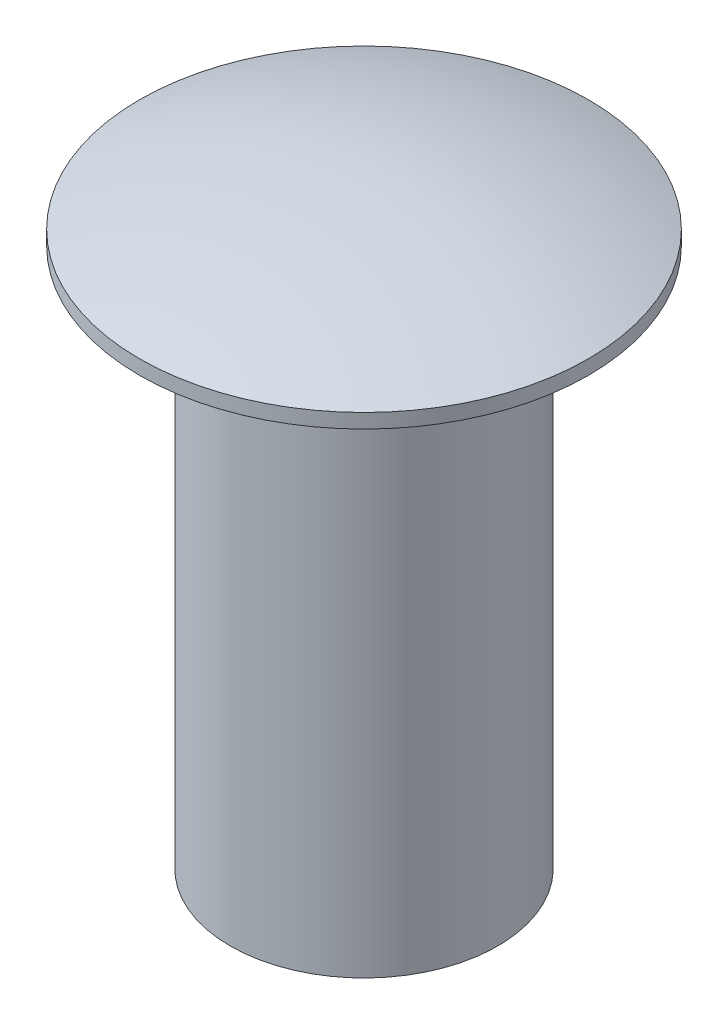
from build123d import *

# Parameters (mm, degrees)
SKETCH1_R           = 1.1811
BOSS_EXTRUDE1_DEPTH = 4.7625
SKETCH2_R           = 1.9812
BOSS_EXTRUDE2_DEPTH = 0.127
DOME1_FACE_RADIUS   = 1.9812
DOME1_HEIGHT        = 0.381
SKETCH3_R           = 0.943992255
CUT_EXTRUDE1_DEPTH  = 0.762


with BuildPart() as part:
    # Sketch1 → Boss-Extrude1 (new body)
    with BuildSketch(Plane(origin=(0, 0, 0), x_dir=(1, 0, 0), z_dir=(0, 1, 0))):
        with Locations(Location((0, 0, 0), (0, 0, 90))):
            Circle(SKETCH1_R)
    extrude(amount=BOSS_EXTRUDE1_DEPTH)

    # Sketch2 → Boss-Extrude2 (add)
    with BuildSketch(Plane(origin=(0, 4.7625, 0), x_dir=(1, 0, 0), z_dir=(0, 1, 0))):
        with Locations(Location((0, 0, 0), (0, 0, 270))):
            Circle(SKETCH2_R)
    extrude(amount=BOSS_EXTRUDE2_DEPTH)

    # Dome1: a dome of height H over a round flat face of radius A is a cap of a sphere of radius (A * A + H * H) / (2 * H)
    dome1_r = (DOME1_FACE_RADIUS * DOME1_FACE_RADIUS + DOME1_HEIGHT * DOME1_HEIGHT) / (2 * DOME1_HEIGHT)
    dome1_base = Plane((0, 4.8895, 0), z_dir=(0, 1, 0))
    with Locations(dome1_base.offset(DOME1_HEIGHT - dome1_r)):
        dome1_ball = Sphere(dome1_r, mode=Mode.PRIVATE)
    add(split(dome1_ball, bisect_by=dome1_base, keep=Keep.TOP, mode=Mode.PRIVATE))

    # Sketch3 → Cut-Extrude1 (cut)
    with BuildSketch(Plane.XZ):
        with Locations(Location((0, 0, 0), (0, 0, 270))):
            Circle(SKETCH3_R)
    extrude(amount=-CUT_EXTRUDE1_DEPTH, mode=Mode.SUBTRACT)


solid = part.part
